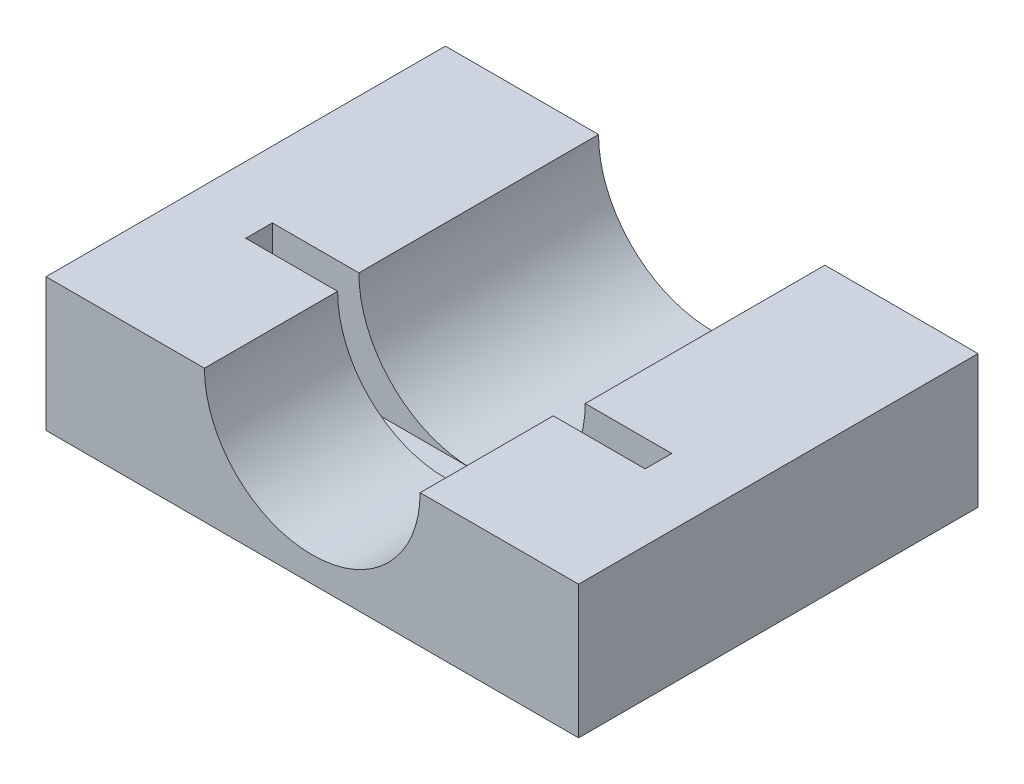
ISO-10303-21;
HEADER;
FILE_DESCRIPTION(('STEP AP214'),'2;1');
FILE_NAME('part.step','',(''),(''),'','','');
FILE_SCHEMA(('AUTOMOTIVE_DESIGN { 1 0 10303 214 1 1 1 1 }'));
ENDSEC;
DATA;
#1=APPLICATION_CONTEXT('core data for automotive mechanical design processes');
#2=APPLICATION_PROTOCOL_DEFINITION('international standard','automotive_design',2000,#1);
#3=PRODUCT_CONTEXT('',#1,'mechanical');
#4=PRODUCT('Part','Part','',(#3));
#5=PRODUCT_RELATED_PRODUCT_CATEGORY('part','',(#4));
#6=PRODUCT_DEFINITION_FORMATION('','',#4);
#7=PRODUCT_DEFINITION_CONTEXT('part definition',#1,'design');
#8=PRODUCT_DEFINITION('design','',#6,#7);
#9=PRODUCT_DEFINITION_SHAPE('','',#8);
#10=(LENGTH_UNIT() NAMED_UNIT(*) SI_UNIT(.MILLI.,.METRE.));
#11=(NAMED_UNIT(*) PLANE_ANGLE_UNIT() SI_UNIT($,.RADIAN.));
#12=(NAMED_UNIT(*) SI_UNIT($,.STERADIAN.) SOLID_ANGLE_UNIT());
#13=UNCERTAINTY_MEASURE_WITH_UNIT(LENGTH_MEASURE(1.E-05),#10,'distance_accuracy_value','');
#14=(GEOMETRIC_REPRESENTATION_CONTEXT(3) GLOBAL_UNCERTAINTY_ASSIGNED_CONTEXT((#13)) GLOBAL_UNIT_ASSIGNED_CONTEXT((#10,
#11,#12)) REPRESENTATION_CONTEXT('',''));
#15=CARTESIAN_POINT('',(0.,0.,0.));
#16=DIRECTION('',(0.,0.,1.));
#17=DIRECTION('',(1.,0.,0.));
#18=AXIS2_PLACEMENT_3D('',#15,#16,#17);
#19=CARTESIAN_POINT('',(0.,10.,30.));
#20=DIRECTION('',(0.,-1.,0.));
#21=DIRECTION('',(1.,0.,0.));
#22=AXIS2_PLACEMENT_3D('',#19,#20,#21);
#23=PLANE('',#22);
#24=DIRECTION('',(-1.,0.,0.));
#25=VECTOR('',#24,1.);
#26=CARTESIAN_POINT('',(0.,10.,30.));
#27=LINE('',#26,#25);
#28=CARTESIAN_POINT('',(-28.0987989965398,10.,30.));
#29=VERTEX_POINT('',#28);
#30=CARTESIAN_POINT('',(-40.,10.,30.));
#31=VERTEX_POINT('',#30);
#32=EDGE_CURVE('E144',#29,#31,#27,.T.);
#33=ORIENTED_EDGE('',*,*,#32,.F.);
#34=DIRECTION('',(0.,0.,-1.));
#35=VECTOR('',#34,1.);
#36=CARTESIAN_POINT('',(-28.0987989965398,10.,41.5));
#37=LINE('',#36,#35);
#38=CARTESIAN_POINT('',(-28.0987989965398,10.,20.));
#39=VERTEX_POINT('',#38);
#40=EDGE_CURVE('E133',#29,#39,#37,.T.);
#41=ORIENTED_EDGE('',*,*,#40,.T.);
#42=DIRECTION('',(1.,0.,0.));
#43=VECTOR('',#42,1.);
#44=CARTESIAN_POINT('',(-35.,10.,20.));
#45=LINE('',#44,#43);
#46=CARTESIAN_POINT('',(-35.,10.,20.));
#47=VERTEX_POINT('',#46);
#48=EDGE_CURVE('E142',#47,#39,#45,.T.);
#49=ORIENTED_EDGE('',*,*,#48,.F.);
#50=DIRECTION('',(0.,0.,1.));
#51=VECTOR('',#50,1.);
#52=CARTESIAN_POINT('',(-35.,10.,18.));
#53=LINE('',#52,#51);
#54=CARTESIAN_POINT('',(-35.,10.,18.));
#55=VERTEX_POINT('',#54);
#56=EDGE_CURVE('E146',#55,#47,#53,.T.);
#57=ORIENTED_EDGE('',*,*,#56,.F.);
#58=DIRECTION('',(-1.,0.,0.));
#59=VECTOR('',#58,1.);
#60=CARTESIAN_POINT('',(-35.,10.,18.));
#61=LINE('',#60,#59);
#62=CARTESIAN_POINT('',(-28.5,10.,18.));
#63=VERTEX_POINT('',#62);
#64=EDGE_CURVE('E159',#63,#55,#61,.T.);
#65=ORIENTED_EDGE('',*,*,#64,.F.);
#66=DIRECTION('',(0.,0.,-1.));
#67=VECTOR('',#66,1.);
#68=CARTESIAN_POINT('',(-28.5,10.,18.));
#69=LINE('',#68,#67);
#70=CARTESIAN_POINT('',(-28.5,10.,0.));
#71=VERTEX_POINT('',#70);
#72=EDGE_CURVE('E193',#63,#71,#69,.T.);
#73=ORIENTED_EDGE('',*,*,#72,.T.);
#74=DIRECTION('',(-1.,0.,0.));
#75=VECTOR('',#74,1.);
#76=CARTESIAN_POINT('',(0.,10.,0.));
#77=LINE('',#76,#75);
#78=CARTESIAN_POINT('',(-40.,10.,0.));
#79=VERTEX_POINT('',#78);
#80=EDGE_CURVE('E219',#71,#79,#77,.T.);
#81=ORIENTED_EDGE('',*,*,#80,.T.);
#82=DIRECTION('',(0.,0.,-1.));
#83=VECTOR('',#82,1.);
#84=CARTESIAN_POINT('',(-40.,10.,30.));
#85=LINE('',#84,#83);
#86=EDGE_CURVE('E236',#31,#79,#85,.T.);
#87=ORIENTED_EDGE('',*,*,#86,.F.);
#88=EDGE_LOOP('',(#33,#41,#49,#57,#65,#73,#81,#87));
#89=FACE_BOUND('',#88,.T.);
#90=ADVANCED_FACE('F41',(#89),#23,.F.);
#91=CARTESIAN_POINT('',(-11.9012010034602,10.,20.));
#92=VERTEX_POINT('',#91);
#93=CARTESIAN_POINT('',(-5.00000000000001,10.,20.));
#94=VERTEX_POINT('',#93);
#95=EDGE_CURVE('E154',#92,#94,#45,.T.);
#96=ORIENTED_EDGE('',*,*,#95,.F.);
#97=DIRECTION('',(0.,0.,-1.));
#98=VECTOR('',#97,1.);
#99=CARTESIAN_POINT('',(-11.9012010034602,10.,41.5));
#100=LINE('',#99,#98);
#101=CARTESIAN_POINT('',(-11.9012010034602,10.,30.));
#102=VERTEX_POINT('',#101);
#103=EDGE_CURVE('E57',#92,#102,#100,.F.);
#104=ORIENTED_EDGE('',*,*,#103,.T.);
#105=CARTESIAN_POINT('',(0.,10.,30.));
#106=VERTEX_POINT('',#105);
#107=EDGE_CURVE('E203',#106,#102,#27,.T.);
#108=ORIENTED_EDGE('',*,*,#107,.F.);
#109=DIRECTION('',(0.,0.,-1.));
#110=VECTOR('',#109,1.);
#111=CARTESIAN_POINT('',(0.,10.,30.));
#112=LINE('',#111,#110);
#113=CARTESIAN_POINT('',(0.,10.,0.));
#114=VERTEX_POINT('',#113);
#115=EDGE_CURVE('E50',#106,#114,#112,.T.);
#116=ORIENTED_EDGE('',*,*,#115,.T.);
#117=CARTESIAN_POINT('',(-11.5,10.,0.));
#118=VERTEX_POINT('',#117);
#119=EDGE_CURVE('E220',#114,#118,#77,.T.);
#120=ORIENTED_EDGE('',*,*,#119,.T.);
#121=DIRECTION('',(0.,0.,-1.));
#122=VECTOR('',#121,1.);
#123=CARTESIAN_POINT('',(-11.5,10.,18.));
#124=LINE('',#123,#122);
#125=CARTESIAN_POINT('',(-11.5,10.,18.));
#126=VERTEX_POINT('',#125);
#127=EDGE_CURVE('E186',#126,#118,#124,.T.);
#128=ORIENTED_EDGE('',*,*,#127,.F.);
#129=CARTESIAN_POINT('',(-5.00000000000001,10.,18.));
#130=VERTEX_POINT('',#129);
#131=EDGE_CURVE('E164',#130,#126,#61,.T.);
#132=ORIENTED_EDGE('',*,*,#131,.F.);
#133=DIRECTION('',(0.,0.,-1.));
#134=VECTOR('',#133,1.);
#135=CARTESIAN_POINT('',(-5.00000000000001,10.,18.));
#136=LINE('',#135,#134);
#137=EDGE_CURVE('E153',#94,#130,#136,.T.);
#138=ORIENTED_EDGE('',*,*,#137,.F.);
#139=EDGE_LOOP('',(#96,#104,#108,#116,#120,#128,#132,#138));
#140=FACE_BOUND('',#139,.T.);
#141=ADVANCED_FACE('F243',(#140),#23,.F.);
#142=CARTESIAN_POINT('',(0.,0.,30.));
#143=DIRECTION('',(-1.,0.,0.));
#144=DIRECTION('',(0.,0.,1.));
#145=AXIS2_PLACEMENT_3D('',#142,#143,#144);
#146=PLANE('',#145);
#147=DIRECTION('',(0.,1.,0.));
#148=VECTOR('',#147,1.);
#149=CARTESIAN_POINT('',(0.,0.,0.));
#150=LINE('',#149,#148);
#151=CARTESIAN_POINT('',(0.,0.,0.));
#152=VERTEX_POINT('',#151);
#153=EDGE_CURVE('E197',#152,#114,#150,.T.);
#154=ORIENTED_EDGE('',*,*,#153,.T.);
#155=ORIENTED_EDGE('',*,*,#115,.F.);
#156=DIRECTION('',(0.,1.,0.));
#157=VECTOR('',#156,1.);
#158=CARTESIAN_POINT('',(0.,0.,30.));
#159=LINE('',#158,#157);
#160=CARTESIAN_POINT('',(0.,0.,30.));
#161=VERTEX_POINT('',#160);
#162=EDGE_CURVE('E198',#161,#106,#159,.T.);
#163=ORIENTED_EDGE('',*,*,#162,.F.);
#164=DIRECTION('',(0.,0.,-1.));
#165=VECTOR('',#164,1.);
#166=CARTESIAN_POINT('',(0.,0.,30.));
#167=LINE('',#166,#165);
#168=EDGE_CURVE('E215',#161,#152,#167,.T.);
#169=ORIENTED_EDGE('',*,*,#168,.T.);
#170=EDGE_LOOP('',(#154,#155,#163,#169));
#171=FACE_BOUND('',#170,.T.);
#172=ADVANCED_FACE('F43',(#171),#146,.F.);
#173=CARTESIAN_POINT('',(-40.,0.,30.));
#174=DIRECTION('',(-1.,0.,0.));
#175=DIRECTION('',(0.,0.,1.));
#176=AXIS2_PLACEMENT_3D('',#173,#174,#175);
#177=PLANE('',#176);
#178=DIRECTION('',(0.,1.,0.));
#179=VECTOR('',#178,1.);
#180=CARTESIAN_POINT('',(-40.,0.,0.));
#181=LINE('',#180,#179);
#182=CARTESIAN_POINT('',(-40.,0.,0.));
#183=VERTEX_POINT('',#182);
#184=EDGE_CURVE('E224',#183,#79,#181,.T.);
#185=ORIENTED_EDGE('',*,*,#184,.F.);
#186=DIRECTION('',(0.,0.,-1.));
#187=VECTOR('',#186,1.);
#188=CARTESIAN_POINT('',(-40.,0.,30.));
#189=LINE('',#188,#187);
#190=CARTESIAN_POINT('',(-40.,0.,30.));
#191=VERTEX_POINT('',#190);
#192=EDGE_CURVE('E233',#191,#183,#189,.T.);
#193=ORIENTED_EDGE('',*,*,#192,.F.);
#194=DIRECTION('',(0.,1.,0.));
#195=VECTOR('',#194,1.);
#196=CARTESIAN_POINT('',(-40.,0.,30.));
#197=LINE('',#196,#195);
#198=EDGE_CURVE('E207',#191,#31,#197,.T.);
#199=ORIENTED_EDGE('',*,*,#198,.T.);
#200=ORIENTED_EDGE('',*,*,#86,.T.);
#201=EDGE_LOOP('',(#185,#193,#199,#200));
#202=FACE_BOUND('',#201,.T.);
#203=ADVANCED_FACE('F257',(#202),#177,.T.);
#204=CARTESIAN_POINT('',(0.,0.,30.));
#205=DIRECTION('',(0.,-1.,0.));
#206=DIRECTION('',(1.,0.,0.));
#207=AXIS2_PLACEMENT_3D('',#204,#205,#206);
#208=PLANE('',#207);
#209=DIRECTION('',(-1.,0.,0.));
#210=VECTOR('',#209,1.);
#211=CARTESIAN_POINT('',(0.,0.,0.));
#212=LINE('',#211,#210);
#213=EDGE_CURVE('E202',#152,#183,#212,.T.);
#214=ORIENTED_EDGE('',*,*,#213,.F.);
#215=ORIENTED_EDGE('',*,*,#168,.F.);
#216=DIRECTION('',(-1.,0.,0.));
#217=VECTOR('',#216,1.);
#218=CARTESIAN_POINT('',(0.,0.,30.));
#219=LINE('',#218,#217);
#220=EDGE_CURVE('E211',#161,#191,#219,.T.);
#221=ORIENTED_EDGE('',*,*,#220,.T.);
#222=ORIENTED_EDGE('',*,*,#192,.T.);
#223=EDGE_LOOP('',(#214,#215,#221,#222));
#224=FACE_BOUND('',#223,.T.);
#225=ADVANCED_FACE('F252',(#224),#208,.T.);
#226=CARTESIAN_POINT('',(0.,0.,30.));
#227=DIRECTION('',(0.,0.,1.));
#228=DIRECTION('',(1.,0.,0.));
#229=AXIS2_PLACEMENT_3D('',#226,#227,#228);
#230=PLANE('',#229);
#231=CARTESIAN_POINT('',(-20.,10.,30.));
#232=DIRECTION('',(0.,0.,1.));
#233=DIRECTION('',(1.,0.,0.));
#234=AXIS2_PLACEMENT_3D('',#231,#232,#233);
#235=CIRCLE('',#234,8.09879899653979);
#236=EDGE_CURVE('E287',#29,#102,#235,.T.);
#237=ORIENTED_EDGE('',*,*,#236,.F.);
#238=ORIENTED_EDGE('',*,*,#32,.T.);
#239=ORIENTED_EDGE('',*,*,#198,.F.);
#240=ORIENTED_EDGE('',*,*,#220,.F.);
#241=ORIENTED_EDGE('',*,*,#162,.T.);
#242=ORIENTED_EDGE('',*,*,#107,.T.);
#243=EDGE_LOOP('',(#237,#238,#239,#240,#241,#242));
#244=FACE_BOUND('',#243,.T.);
#245=ADVANCED_FACE('F292',(#244),#230,.T.);
#246=CARTESIAN_POINT('',(0.,0.,0.));
#247=DIRECTION('',(0.,0.,1.));
#248=DIRECTION('',(1.,0.,0.));
#249=AXIS2_PLACEMENT_3D('',#246,#247,#248);
#250=PLANE('',#249);
#251=CARTESIAN_POINT('',(-20.,10.,0.));
#252=DIRECTION('',(0.,0.,1.));
#253=DIRECTION('',(1.,0.,0.));
#254=AXIS2_PLACEMENT_3D('',#251,#252,#253);
#255=CIRCLE('',#254,8.5);
#256=EDGE_CURVE('E172',#71,#118,#255,.T.);
#257=ORIENTED_EDGE('',*,*,#256,.T.);
#258=ORIENTED_EDGE('',*,*,#119,.F.);
#259=ORIENTED_EDGE('',*,*,#153,.F.);
#260=ORIENTED_EDGE('',*,*,#213,.T.);
#261=ORIENTED_EDGE('',*,*,#184,.T.);
#262=ORIENTED_EDGE('',*,*,#80,.F.);
#263=EDGE_LOOP('',(#257,#258,#259,#260,#261,#262));
#264=FACE_BOUND('',#263,.T.);
#265=ADVANCED_FACE('F250',(#264),#250,.F.);
#266=CARTESIAN_POINT('',(-20.,10.,18.));
#267=DIRECTION('',(0.,0.,-1.));
#268=DIRECTION('',(-1.,0.,0.));
#269=AXIS2_PLACEMENT_3D('',#266,#267,#268);
#270=CYLINDRICAL_SURFACE('',#269,8.5);
#271=ORIENTED_EDGE('',*,*,#256,.F.);
#272=ORIENTED_EDGE('',*,*,#72,.F.);
#273=CARTESIAN_POINT('',(-20.,10.,18.));
#274=DIRECTION('',(0.,0.,1.));
#275=DIRECTION('',(1.,0.,0.));
#276=AXIS2_PLACEMENT_3D('',#273,#274,#275);
#277=CIRCLE('',#276,8.5);
#278=CARTESIAN_POINT('',(-20.,1.5,18.));
#279=VERTEX_POINT('',#278);
#280=EDGE_CURVE('E182',#63,#279,#277,.T.);
#281=ORIENTED_EDGE('',*,*,#280,.T.);
#282=EDGE_CURVE('E187',#279,#126,#277,.T.);
#283=ORIENTED_EDGE('',*,*,#282,.T.);
#284=ORIENTED_EDGE('',*,*,#127,.T.);
#285=EDGE_LOOP('',(#271,#272,#281,#283,#284));
#286=FACE_BOUND('',#285,.T.);
#287=ADVANCED_FACE('F300',(#286),#270,.F.);
#288=CARTESIAN_POINT('',(-35.,1.5,18.));
#289=DIRECTION('',(0.,0.,-1.));
#290=DIRECTION('',(-1.,0.,0.));
#291=AXIS2_PLACEMENT_3D('',#288,#289,#290);
#292=PLANE('',#291);
#293=ORIENTED_EDGE('',*,*,#282,.F.);
#294=DIRECTION('',(-1.,0.,0.));
#295=VECTOR('',#294,1.);
#296=CARTESIAN_POINT('',(-35.,1.5,18.));
#297=LINE('',#296,#295);
#298=CARTESIAN_POINT('',(-5.,1.5,18.));
#299=VERTEX_POINT('',#298);
#300=EDGE_CURVE('E64',#299,#279,#297,.T.);
#301=ORIENTED_EDGE('',*,*,#300,.F.);
#302=DIRECTION('',(0.,1.,0.));
#303=VECTOR('',#302,1.);
#304=CARTESIAN_POINT('',(-5.,1.5,18.));
#305=LINE('',#304,#303);
#306=EDGE_CURVE('E173',#299,#130,#305,.T.);
#307=ORIENTED_EDGE('',*,*,#306,.T.);
#308=ORIENTED_EDGE('',*,*,#131,.T.);
#309=EDGE_LOOP('',(#293,#301,#307,#308));
#310=FACE_BOUND('',#309,.T.);
#311=ADVANCED_FACE('F374',(#310),#292,.F.);
#312=CARTESIAN_POINT('',(-35.,1.5,18.));
#313=DIRECTION('',(-1.,0.,0.));
#314=DIRECTION('',(0.,-1.,0.));
#315=AXIS2_PLACEMENT_3D('',#312,#313,#314);
#316=PLANE('',#315);
#317=ORIENTED_EDGE('',*,*,#56,.T.);
#318=DIRECTION('',(0.,1.,0.));
#319=VECTOR('',#318,1.);
#320=CARTESIAN_POINT('',(-35.,1.5,20.));
#321=LINE('',#320,#319);
#322=CARTESIAN_POINT('',(-35.,1.5,20.));
#323=VERTEX_POINT('',#322);
#324=EDGE_CURVE('E150',#323,#47,#321,.T.);
#325=ORIENTED_EDGE('',*,*,#324,.F.);
#326=DIRECTION('',(0.,0.,1.));
#327=VECTOR('',#326,1.);
#328=CARTESIAN_POINT('',(-35.,1.5,18.));
#329=LINE('',#328,#327);
#330=CARTESIAN_POINT('',(-35.,1.5,18.));
#331=VERTEX_POINT('',#330);
#332=EDGE_CURVE('E167',#331,#323,#329,.T.);
#333=ORIENTED_EDGE('',*,*,#332,.F.);
#334=DIRECTION('',(0.,1.,0.));
#335=VECTOR('',#334,1.);
#336=CARTESIAN_POINT('',(-35.,1.5,18.));
#337=LINE('',#336,#335);
#338=EDGE_CURVE('E168',#331,#55,#337,.T.);
#339=ORIENTED_EDGE('',*,*,#338,.T.);
#340=EDGE_LOOP('',(#317,#325,#333,#339));
#341=FACE_BOUND('',#340,.T.);
#342=ADVANCED_FACE('F283',(#341),#316,.F.);
#343=ORIENTED_EDGE('',*,*,#280,.F.);
#344=ORIENTED_EDGE('',*,*,#64,.T.);
#345=ORIENTED_EDGE('',*,*,#338,.F.);
#346=EDGE_CURVE('E264',#279,#331,#297,.T.);
#347=ORIENTED_EDGE('',*,*,#346,.F.);
#348=EDGE_LOOP('',(#343,#344,#345,#347));
#349=FACE_BOUND('',#348,.T.);
#350=ADVANCED_FACE('F279',(#349),#292,.F.);
#351=CARTESIAN_POINT('',(-5.,1.5,18.));
#352=DIRECTION('',(1.,0.,0.));
#353=DIRECTION('',(0.,1.,0.));
#354=AXIS2_PLACEMENT_3D('',#351,#352,#353);
#355=PLANE('',#354);
#356=ORIENTED_EDGE('',*,*,#137,.T.);
#357=ORIENTED_EDGE('',*,*,#306,.F.);
#358=DIRECTION('',(0.,0.,-1.));
#359=VECTOR('',#358,1.);
#360=CARTESIAN_POINT('',(-5.,1.5,18.));
#361=LINE('',#360,#359);
#362=CARTESIAN_POINT('',(-5.,1.5,20.));
#363=VERTEX_POINT('',#362);
#364=EDGE_CURVE('E266',#363,#299,#361,.T.);
#365=ORIENTED_EDGE('',*,*,#364,.F.);
#366=DIRECTION('',(0.,1.,0.));
#367=VECTOR('',#366,1.);
#368=CARTESIAN_POINT('',(-5.,1.5,20.));
#369=LINE('',#368,#367);
#370=EDGE_CURVE('E176',#363,#94,#369,.T.);
#371=ORIENTED_EDGE('',*,*,#370,.T.);
#372=EDGE_LOOP('',(#356,#357,#365,#371));
#373=FACE_BOUND('',#372,.T.);
#374=ADVANCED_FACE('F340',(#373),#355,.F.);
#375=CARTESIAN_POINT('',(-35.,1.5,20.));
#376=DIRECTION('',(0.,0.,1.));
#377=DIRECTION('',(1.,0.,0.));
#378=AXIS2_PLACEMENT_3D('',#375,#376,#377);
#379=PLANE('',#378);
#380=ORIENTED_EDGE('',*,*,#48,.T.);
#381=CARTESIAN_POINT('',(-20.,10.,20.));
#382=DIRECTION('',(0.,0.,1.));
#383=DIRECTION('',(1.,0.,0.));
#384=AXIS2_PLACEMENT_3D('',#381,#382,#383);
#385=CIRCLE('',#384,8.09879899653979);
#386=EDGE_CURVE('E11',#39,#92,#385,.T.);
#387=ORIENTED_EDGE('',*,*,#386,.T.);
#388=ORIENTED_EDGE('',*,*,#95,.T.);
#389=ORIENTED_EDGE('',*,*,#370,.F.);
#390=DIRECTION('',(1.,0.,0.));
#391=VECTOR('',#390,1.);
#392=CARTESIAN_POINT('',(-35.,1.5,20.));
#393=LINE('',#392,#391);
#394=EDGE_CURVE('E268',#323,#363,#393,.T.);
#395=ORIENTED_EDGE('',*,*,#394,.F.);
#396=ORIENTED_EDGE('',*,*,#324,.T.);
#397=EDGE_LOOP('',(#380,#387,#388,#389,#395,#396));
#398=FACE_BOUND('',#397,.T.);
#399=ADVANCED_FACE('F148',(#398),#379,.F.);
#400=CARTESIAN_POINT('',(0.,1.5,0.));
#401=DIRECTION('',(0.,1.,0.));
#402=DIRECTION('',(-1.,0.,0.));
#403=AXIS2_PLACEMENT_3D('',#400,#401,#402);
#404=PLANE('',#403);
#405=ORIENTED_EDGE('',*,*,#332,.T.);
#406=ORIENTED_EDGE('',*,*,#394,.T.);
#407=ORIENTED_EDGE('',*,*,#364,.T.);
#408=ORIENTED_EDGE('',*,*,#300,.T.);
#409=ORIENTED_EDGE('',*,*,#346,.T.);
#410=EDGE_LOOP('',(#405,#406,#407,#408,#409));
#411=FACE_BOUND('',#410,.T.);
#412=ADVANCED_FACE('F339',(#411),#404,.T.);
#413=CARTESIAN_POINT('',(-20.,10.,41.5));
#414=DIRECTION('',(0.,0.,-1.));
#415=DIRECTION('',(-1.,0.,0.));
#416=AXIS2_PLACEMENT_3D('',#413,#414,#415);
#417=CYLINDRICAL_SURFACE('',#416,8.09879899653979);
#418=ORIENTED_EDGE('',*,*,#236,.T.);
#419=ORIENTED_EDGE('',*,*,#103,.F.);
#420=ORIENTED_EDGE('',*,*,#386,.F.);
#421=ORIENTED_EDGE('',*,*,#40,.F.);
#422=EDGE_LOOP('',(#418,#419,#420,#421));
#423=FACE_BOUND('',#422,.T.);
#424=ADVANCED_FACE('F132',(#423),#417,.F.);
#425=CLOSED_SHELL('',(#90,#141,#172,#203,#225,#245,#265,#287,#311,#342,#350,#374,#399,#412,#424));
#426=MANIFOLD_SOLID_BREP('B2',#425);
#427=ADVANCED_BREP_SHAPE_REPRESENTATION('',(#18,#426),#14);
#428=SHAPE_DEFINITION_REPRESENTATION(#9,#427);
ENDSEC;
END-ISO-10303-21;
